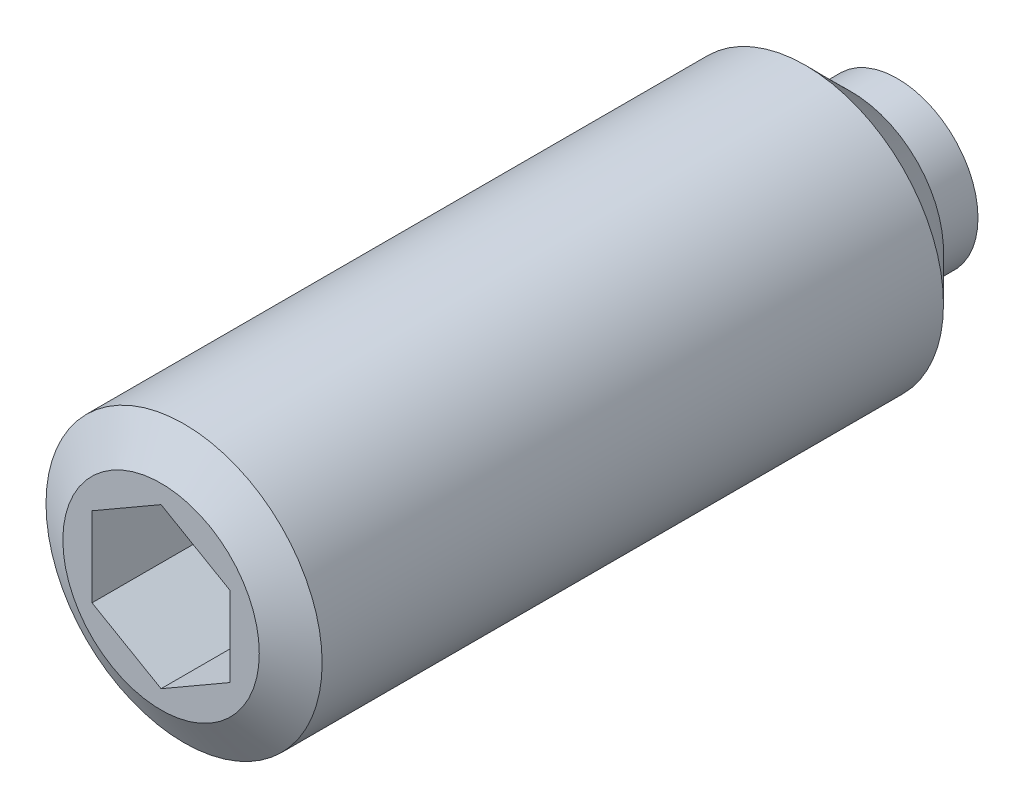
ISO-10303-21;
HEADER;
FILE_DESCRIPTION(('STEP AP214'),'2;1');
FILE_NAME('part.step','',(''),(''),'','','');
FILE_SCHEMA(('AUTOMOTIVE_DESIGN { 1 0 10303 214 1 1 1 1 }'));
ENDSEC;
DATA;
#1=APPLICATION_CONTEXT('core data for automotive mechanical design processes');
#2=APPLICATION_PROTOCOL_DEFINITION('international standard','automotive_design',2000,#1);
#3=PRODUCT_CONTEXT('',#1,'mechanical');
#4=PRODUCT('Part','Part','',(#3));
#5=PRODUCT_RELATED_PRODUCT_CATEGORY('part','',(#4));
#6=PRODUCT_DEFINITION_FORMATION('','',#4);
#7=PRODUCT_DEFINITION_CONTEXT('part definition',#1,'design');
#8=PRODUCT_DEFINITION('design','',#6,#7);
#9=PRODUCT_DEFINITION_SHAPE('','',#8);
#10=(LENGTH_UNIT() NAMED_UNIT(*) SI_UNIT(.MILLI.,.METRE.));
#11=(NAMED_UNIT(*) PLANE_ANGLE_UNIT() SI_UNIT($,.RADIAN.));
#12=(NAMED_UNIT(*) SI_UNIT($,.STERADIAN.) SOLID_ANGLE_UNIT());
#13=UNCERTAINTY_MEASURE_WITH_UNIT(LENGTH_MEASURE(1.E-05),#10,'distance_accuracy_value','');
#14=(GEOMETRIC_REPRESENTATION_CONTEXT(3) GLOBAL_UNCERTAINTY_ASSIGNED_CONTEXT((#13)) GLOBAL_UNIT_ASSIGNED_CONTEXT((#10,
#11,#12)) REPRESENTATION_CONTEXT('',''));
#15=CARTESIAN_POINT('',(0.,0.,0.));
#16=DIRECTION('',(0.,0.,1.));
#17=DIRECTION('',(1.,0.,0.));
#18=AXIS2_PLACEMENT_3D('',#15,#16,#17);
#19=CARTESIAN_POINT('',(3.5,0.,0.));
#20=DIRECTION('',(0.,0.,-1.));
#21=DIRECTION('',(-1.,0.,0.));
#22=AXIS2_PLACEMENT_3D('',#19,#20,#21);
#23=PLANE('',#22);
#24=CARTESIAN_POINT('',(0.,0.,0.));
#25=DIRECTION('',(0.,0.,1.));
#26=DIRECTION('',(1.,0.,0.));
#27=AXIS2_PLACEMENT_3D('',#24,#25,#26);
#28=CIRCLE('',#27,3.5);
#29=CARTESIAN_POINT('',(3.5,0.,0.));
#30=VERTEX_POINT('',#29);
#31=EDGE_CURVE('E124',#30,#30,#28,.T.);
#32=ORIENTED_EDGE('',*,*,#31,.F.);
#33=EDGE_LOOP('',(#32));
#34=FACE_BOUND('',#33,.T.);
#35=ADVANCED_FACE('F14',(#34),#23,.T.);
#36=CARTESIAN_POINT('',(0.,0.,52.));
#37=DIRECTION('',(0.,0.,1.));
#38=DIRECTION('',(1.,0.,0.));
#39=AXIS2_PLACEMENT_3D('',#36,#37,#38);
#40=CYLINDRICAL_SURFACE('',#39,3.5);
#41=CARTESIAN_POINT('',(0.,0.,2.));
#42=DIRECTION('',(0.,0.,1.));
#43=DIRECTION('',(1.,0.,0.));
#44=AXIS2_PLACEMENT_3D('',#41,#42,#43);
#45=CIRCLE('',#44,3.5);
#46=CARTESIAN_POINT('',(3.5,0.,2.));
#47=VERTEX_POINT('',#46);
#48=EDGE_CURVE('E121',#47,#47,#45,.T.);
#49=ORIENTED_EDGE('',*,*,#48,.F.);
#50=EDGE_LOOP('',(#49));
#51=FACE_BOUND('',#50,.T.);
#52=ORIENTED_EDGE('',*,*,#31,.T.);
#53=EDGE_LOOP('',(#52));
#54=FACE_BOUND('',#53,.T.);
#55=ADVANCED_FACE('F149',(#51,#54),#40,.T.);
#56=CARTESIAN_POINT('',(6.,0.,2.));
#57=DIRECTION('',(0.,0.,-1.));
#58=DIRECTION('',(-1.,0.,0.));
#59=AXIS2_PLACEMENT_3D('',#56,#57,#58);
#60=PLANE('',#59);
#61=CARTESIAN_POINT('',(0.,0.,2.));
#62=DIRECTION('',(0.,0.,-1.));
#63=DIRECTION('',(-1.,0.,0.));
#64=AXIS2_PLACEMENT_3D('',#61,#62,#63);
#65=CIRCLE('',#64,4.);
#66=CARTESIAN_POINT('',(-4.,0.,2.));
#67=VERTEX_POINT('',#66);
#68=EDGE_CURVE('E130',#67,#67,#65,.T.);
#69=ORIENTED_EDGE('',*,*,#68,.T.);
#70=EDGE_LOOP('',(#69));
#71=FACE_BOUND('',#70,.T.);
#72=ORIENTED_EDGE('',*,*,#48,.T.);
#73=EDGE_LOOP('',(#72));
#74=FACE_BOUND('',#73,.T.);
#75=ADVANCED_FACE('F155',(#71,#74),#60,.T.);
#76=CARTESIAN_POINT('',(0.,0.,52.));
#77=DIRECTION('',(0.,0.,1.));
#78=DIRECTION('',(1.,0.,0.));
#79=AXIS2_PLACEMENT_3D('',#76,#77,#78);
#80=CYLINDRICAL_SURFACE('',#79,6.);
#81=CARTESIAN_POINT('',(0.,0.,31.));
#82=DIRECTION('',(0.,0.,1.));
#83=DIRECTION('',(1.,0.,0.));
#84=AXIS2_PLACEMENT_3D('',#81,#82,#83);
#85=CIRCLE('',#84,6.);
#86=CARTESIAN_POINT('',(6.,0.,31.));
#87=VERTEX_POINT('',#86);
#88=EDGE_CURVE('E9',#87,#87,#85,.F.);
#89=ORIENTED_EDGE('',*,*,#88,.T.);
#90=EDGE_LOOP('',(#89));
#91=FACE_BOUND('',#90,.T.);
#92=CARTESIAN_POINT('',(0.,0.,4.));
#93=DIRECTION('',(0.,0.,-1.));
#94=DIRECTION('',(-1.,0.,0.));
#95=AXIS2_PLACEMENT_3D('',#92,#93,#94);
#96=CIRCLE('',#95,6.);
#97=CARTESIAN_POINT('',(-6.,0.,4.));
#98=VERTEX_POINT('',#97);
#99=EDGE_CURVE('E127',#98,#98,#96,.F.);
#100=ORIENTED_EDGE('',*,*,#99,.T.);
#101=EDGE_LOOP('',(#100));
#102=FACE_BOUND('',#101,.T.);
#103=ADVANCED_FACE('F162',(#91,#102),#80,.T.);
#104=CARTESIAN_POINT('',(0.,0.,32.));
#105=DIRECTION('',(0.,0.,1.));
#106=DIRECTION('',(1.,0.,0.));
#107=AXIS2_PLACEMENT_3D('',#104,#105,#106);
#108=PLANE('',#107);
#109=CARTESIAN_POINT('',(0.,0.,32.));
#110=DIRECTION('',(0.,0.,1.));
#111=DIRECTION('',(1.,0.,0.));
#112=AXIS2_PLACEMENT_3D('',#109,#110,#111);
#113=CIRCLE('',#112,4.26794919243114);
#114=CARTESIAN_POINT('',(4.26794919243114,0.,32.));
#115=VERTEX_POINT('',#114);
#116=EDGE_CURVE('E22',#115,#115,#113,.T.);
#117=ORIENTED_EDGE('',*,*,#116,.T.);
#118=EDGE_LOOP('',(#117));
#119=FACE_BOUND('',#118,.T.);
#120=DIRECTION('',(0.86602540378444,-0.5,0.));
#121=VECTOR('',#120,1.);
#122=CARTESIAN_POINT('',(-3.,-1.73205080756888,32.));
#123=LINE('',#122,#121);
#124=CARTESIAN_POINT('',(-3.,-1.73205080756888,32.));
#125=VERTEX_POINT('',#124);
#126=CARTESIAN_POINT('',(0.,-3.46410161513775,32.));
#127=VERTEX_POINT('',#126);
#128=EDGE_CURVE('E29',#125,#127,#123,.T.);
#129=ORIENTED_EDGE('',*,*,#128,.F.);
#130=DIRECTION('',(0.,-1.,0.));
#131=VECTOR('',#130,1.);
#132=CARTESIAN_POINT('',(-3.,1.73205080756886,32.));
#133=LINE('',#132,#131);
#134=CARTESIAN_POINT('',(-3.,1.73205080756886,32.));
#135=VERTEX_POINT('',#134);
#136=EDGE_CURVE('E97',#135,#125,#133,.T.);
#137=ORIENTED_EDGE('',*,*,#136,.F.);
#138=DIRECTION('',(0.866025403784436,0.5,0.));
#139=VECTOR('',#138,1.);
#140=CARTESIAN_POINT('',(-3.,1.73205080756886,32.));
#141=LINE('',#140,#139);
#142=CARTESIAN_POINT('',(0.,3.46410161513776,32.));
#143=VERTEX_POINT('',#142);
#144=EDGE_CURVE('E92',#135,#143,#141,.T.);
#145=ORIENTED_EDGE('',*,*,#144,.T.);
#146=DIRECTION('',(-0.866025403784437,0.5,0.));
#147=VECTOR('',#146,1.);
#148=CARTESIAN_POINT('',(3.,1.73205080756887,32.));
#149=LINE('',#148,#147);
#150=CARTESIAN_POINT('',(3.,1.73205080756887,32.));
#151=VERTEX_POINT('',#150);
#152=EDGE_CURVE('E90',#151,#143,#149,.T.);
#153=ORIENTED_EDGE('',*,*,#152,.F.);
#154=DIRECTION('',(0.,-1.,0.));
#155=VECTOR('',#154,1.);
#156=CARTESIAN_POINT('',(3.,1.73205080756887,32.));
#157=LINE('',#156,#155);
#158=CARTESIAN_POINT('',(3.,-1.73205080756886,32.));
#159=VERTEX_POINT('',#158);
#160=EDGE_CURVE('E72',#151,#159,#157,.T.);
#161=ORIENTED_EDGE('',*,*,#160,.T.);
#162=DIRECTION('',(-0.866025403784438,-0.5,0.));
#163=VECTOR('',#162,1.);
#164=CARTESIAN_POINT('',(3.,-1.73205080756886,32.));
#165=LINE('',#164,#163);
#166=EDGE_CURVE('E83',#159,#127,#165,.T.);
#167=ORIENTED_EDGE('',*,*,#166,.T.);
#168=EDGE_LOOP('',(#129,#137,#145,#153,#161,#167));
#169=FACE_BOUND('',#168,.T.);
#170=ADVANCED_FACE('F87',(#119,#169),#108,.T.);
#171=CARTESIAN_POINT('',(-3.,-1.73205080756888,27.));
#172=DIRECTION('',(-0.5,-0.86602540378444,0.));
#173=DIRECTION('',(-0.86602540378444,0.5,0.));
#174=AXIS2_PLACEMENT_3D('',#171,#172,#173);
#175=PLANE('',#174);
#176=DIRECTION('',(0.,0.,1.));
#177=VECTOR('',#176,1.);
#178=CARTESIAN_POINT('',(-3.,-1.73205080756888,27.));
#179=LINE('',#178,#177);
#180=CARTESIAN_POINT('',(-3.,-1.73205080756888,27.));
#181=VERTEX_POINT('',#180);
#182=EDGE_CURVE('E36',#181,#125,#179,.T.);
#183=ORIENTED_EDGE('',*,*,#182,.T.);
#184=ORIENTED_EDGE('',*,*,#128,.T.);
#185=DIRECTION('',(0.,0.,1.));
#186=VECTOR('',#185,1.);
#187=CARTESIAN_POINT('',(0.,-3.46410161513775,27.));
#188=LINE('',#187,#186);
#189=CARTESIAN_POINT('',(0.,-3.46410161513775,27.));
#190=VERTEX_POINT('',#189);
#191=EDGE_CURVE('E80',#190,#127,#188,.T.);
#192=ORIENTED_EDGE('',*,*,#191,.F.);
#193=DIRECTION('',(0.86602540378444,-0.5,0.));
#194=VECTOR('',#193,1.);
#195=CARTESIAN_POINT('',(-3.,-1.73205080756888,27.));
#196=LINE('',#195,#194);
#197=EDGE_CURVE('E99',#181,#190,#196,.T.);
#198=ORIENTED_EDGE('',*,*,#197,.F.);
#199=EDGE_LOOP('',(#183,#184,#192,#198));
#200=FACE_BOUND('',#199,.T.);
#201=ADVANCED_FACE('F169',(#200),#175,.F.);
#202=CARTESIAN_POINT('',(-3.,1.73205080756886,27.));
#203=DIRECTION('',(-1.,0.,0.));
#204=DIRECTION('',(0.,1.,0.));
#205=AXIS2_PLACEMENT_3D('',#202,#203,#204);
#206=PLANE('',#205);
#207=DIRECTION('',(0.,0.,1.));
#208=VECTOR('',#207,1.);
#209=CARTESIAN_POINT('',(-3.,1.73205080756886,27.));
#210=LINE('',#209,#208);
#211=CARTESIAN_POINT('',(-3.,1.73205080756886,27.));
#212=VERTEX_POINT('',#211);
#213=EDGE_CURVE('E118',#212,#135,#210,.T.);
#214=ORIENTED_EDGE('',*,*,#213,.T.);
#215=ORIENTED_EDGE('',*,*,#136,.T.);
#216=ORIENTED_EDGE('',*,*,#182,.F.);
#217=DIRECTION('',(0.,-1.,0.));
#218=VECTOR('',#217,1.);
#219=CARTESIAN_POINT('',(-3.,1.73205080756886,27.));
#220=LINE('',#219,#218);
#221=EDGE_CURVE('E111',#212,#181,#220,.T.);
#222=ORIENTED_EDGE('',*,*,#221,.F.);
#223=EDGE_LOOP('',(#214,#215,#216,#222));
#224=FACE_BOUND('',#223,.T.);
#225=ADVANCED_FACE('F170',(#224),#206,.F.);
#226=CARTESIAN_POINT('',(-3.,1.73205080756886,27.));
#227=DIRECTION('',(0.5,-0.866025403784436,0.));
#228=DIRECTION('',(-0.866025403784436,-0.5,0.));
#229=AXIS2_PLACEMENT_3D('',#226,#227,#228);
#230=PLANE('',#229);
#231=DIRECTION('',(0.,0.,1.));
#232=VECTOR('',#231,1.);
#233=CARTESIAN_POINT('',(0.,3.46410161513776,27.));
#234=LINE('',#233,#232);
#235=CARTESIAN_POINT('',(0.,3.46410161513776,27.));
#236=VERTEX_POINT('',#235);
#237=EDGE_CURVE('E116',#236,#143,#234,.T.);
#238=ORIENTED_EDGE('',*,*,#237,.T.);
#239=ORIENTED_EDGE('',*,*,#144,.F.);
#240=ORIENTED_EDGE('',*,*,#213,.F.);
#241=DIRECTION('',(0.866025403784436,0.5,0.));
#242=VECTOR('',#241,1.);
#243=CARTESIAN_POINT('',(-3.,1.73205080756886,27.));
#244=LINE('',#243,#242);
#245=EDGE_CURVE('E108',#212,#236,#244,.T.);
#246=ORIENTED_EDGE('',*,*,#245,.T.);
#247=EDGE_LOOP('',(#238,#239,#240,#246));
#248=FACE_BOUND('',#247,.T.);
#249=ADVANCED_FACE('F173',(#248),#230,.T.);
#250=CARTESIAN_POINT('',(3.,1.73205080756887,27.));
#251=DIRECTION('',(0.5,0.866025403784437,0.));
#252=DIRECTION('',(0.866025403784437,-0.5,0.));
#253=AXIS2_PLACEMENT_3D('',#250,#251,#252);
#254=PLANE('',#253);
#255=DIRECTION('',(0.,0.,1.));
#256=VECTOR('',#255,1.);
#257=CARTESIAN_POINT('',(3.,1.73205080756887,27.));
#258=LINE('',#257,#256);
#259=CARTESIAN_POINT('',(3.,1.73205080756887,27.));
#260=VERTEX_POINT('',#259);
#261=EDGE_CURVE('E79',#260,#151,#258,.T.);
#262=ORIENTED_EDGE('',*,*,#261,.T.);
#263=ORIENTED_EDGE('',*,*,#152,.T.);
#264=ORIENTED_EDGE('',*,*,#237,.F.);
#265=DIRECTION('',(-0.866025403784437,0.5,0.));
#266=VECTOR('',#265,1.);
#267=CARTESIAN_POINT('',(3.,1.73205080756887,27.));
#268=LINE('',#267,#266);
#269=EDGE_CURVE('E105',#260,#236,#268,.T.);
#270=ORIENTED_EDGE('',*,*,#269,.F.);
#271=EDGE_LOOP('',(#262,#263,#264,#270));
#272=FACE_BOUND('',#271,.T.);
#273=ADVANCED_FACE('F176',(#272),#254,.F.);
#274=CARTESIAN_POINT('',(3.,1.73205080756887,27.));
#275=DIRECTION('',(-1.,0.,0.));
#276=DIRECTION('',(0.,1.,0.));
#277=AXIS2_PLACEMENT_3D('',#274,#275,#276);
#278=PLANE('',#277);
#279=DIRECTION('',(0.,0.,1.));
#280=VECTOR('',#279,1.);
#281=CARTESIAN_POINT('',(3.,-1.73205080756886,27.));
#282=LINE('',#281,#280);
#283=CARTESIAN_POINT('',(3.,-1.73205080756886,27.));
#284=VERTEX_POINT('',#283);
#285=EDGE_CURVE('E68',#284,#159,#282,.T.);
#286=ORIENTED_EDGE('',*,*,#285,.T.);
#287=ORIENTED_EDGE('',*,*,#160,.F.);
#288=ORIENTED_EDGE('',*,*,#261,.F.);
#289=DIRECTION('',(0.,-1.,0.));
#290=VECTOR('',#289,1.);
#291=CARTESIAN_POINT('',(3.,1.73205080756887,27.));
#292=LINE('',#291,#290);
#293=EDGE_CURVE('E75',#260,#284,#292,.T.);
#294=ORIENTED_EDGE('',*,*,#293,.T.);
#295=EDGE_LOOP('',(#286,#287,#288,#294));
#296=FACE_BOUND('',#295,.T.);
#297=ADVANCED_FACE('F70',(#296),#278,.T.);
#298=CARTESIAN_POINT('',(3.,-1.73205080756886,27.));
#299=DIRECTION('',(-0.5,0.866025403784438,0.));
#300=DIRECTION('',(0.866025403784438,0.5,0.));
#301=AXIS2_PLACEMENT_3D('',#298,#299,#300);
#302=PLANE('',#301);
#303=DIRECTION('',(-0.866025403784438,-0.5,0.));
#304=VECTOR('',#303,1.);
#305=CARTESIAN_POINT('',(3.,-1.73205080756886,27.));
#306=LINE('',#305,#304);
#307=EDGE_CURVE('E102',#284,#190,#306,.T.);
#308=ORIENTED_EDGE('',*,*,#307,.T.);
#309=ORIENTED_EDGE('',*,*,#191,.T.);
#310=ORIENTED_EDGE('',*,*,#166,.F.);
#311=ORIENTED_EDGE('',*,*,#285,.F.);
#312=EDGE_LOOP('',(#308,#309,#310,#311));
#313=FACE_BOUND('',#312,.T.);
#314=ADVANCED_FACE('F84',(#313),#302,.T.);
#315=CARTESIAN_POINT('',(-6.,0.,27.));
#316=DIRECTION('',(0.,0.,1.));
#317=DIRECTION('',(1.,0.,0.));
#318=AXIS2_PLACEMENT_3D('',#315,#316,#317);
#319=PLANE('',#318);
#320=ORIENTED_EDGE('',*,*,#197,.T.);
#321=ORIENTED_EDGE('',*,*,#307,.F.);
#322=ORIENTED_EDGE('',*,*,#293,.F.);
#323=ORIENTED_EDGE('',*,*,#269,.T.);
#324=ORIENTED_EDGE('',*,*,#245,.F.);
#325=ORIENTED_EDGE('',*,*,#221,.T.);
#326=EDGE_LOOP('',(#320,#321,#322,#323,#324,#325));
#327=FACE_BOUND('',#326,.T.);
#328=ADVANCED_FACE('F144',(#327),#319,.T.);
#329=CARTESIAN_POINT('',(0.,0.,4.));
#330=DIRECTION('',(0.,0.,1.));
#331=DIRECTION('',(1.,0.,0.));
#332=AXIS2_PLACEMENT_3D('',#329,#330,#331);
#333=CONICAL_SURFACE('',#332,6.,0.785398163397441);
#334=ORIENTED_EDGE('',*,*,#68,.F.);
#335=EDGE_LOOP('',(#334));
#336=FACE_BOUND('',#335,.T.);
#337=ORIENTED_EDGE('',*,*,#99,.F.);
#338=EDGE_LOOP('',(#337));
#339=FACE_BOUND('',#338,.T.);
#340=ADVANCED_FACE('F137',(#336,#339),#333,.T.);
#341=CARTESIAN_POINT('',(0.,0.,32.));
#342=DIRECTION('',(0.,0.,-1.));
#343=DIRECTION('',(-1.,0.,0.));
#344=AXIS2_PLACEMENT_3D('',#341,#342,#343);
#345=CONICAL_SURFACE('',#344,4.26794919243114,1.0471975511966);
#346=ORIENTED_EDGE('',*,*,#88,.F.);
#347=EDGE_LOOP('',(#346));
#348=FACE_BOUND('',#347,.T.);
#349=ORIENTED_EDGE('',*,*,#116,.F.);
#350=EDGE_LOOP('',(#349));
#351=FACE_BOUND('',#350,.T.);
#352=ADVANCED_FACE('F16',(#348,#351),#345,.T.);
#353=CLOSED_SHELL('',(#35,#55,#75,#103,#170,#201,#225,#249,#273,#297,#314,#328,#340,#352));
#354=MANIFOLD_SOLID_BREP('B1',#353);
#355=ADVANCED_BREP_SHAPE_REPRESENTATION('',(#18,#354),#14);
#356=SHAPE_DEFINITION_REPRESENTATION(#9,#355);
ENDSEC;
END-ISO-10303-21;
